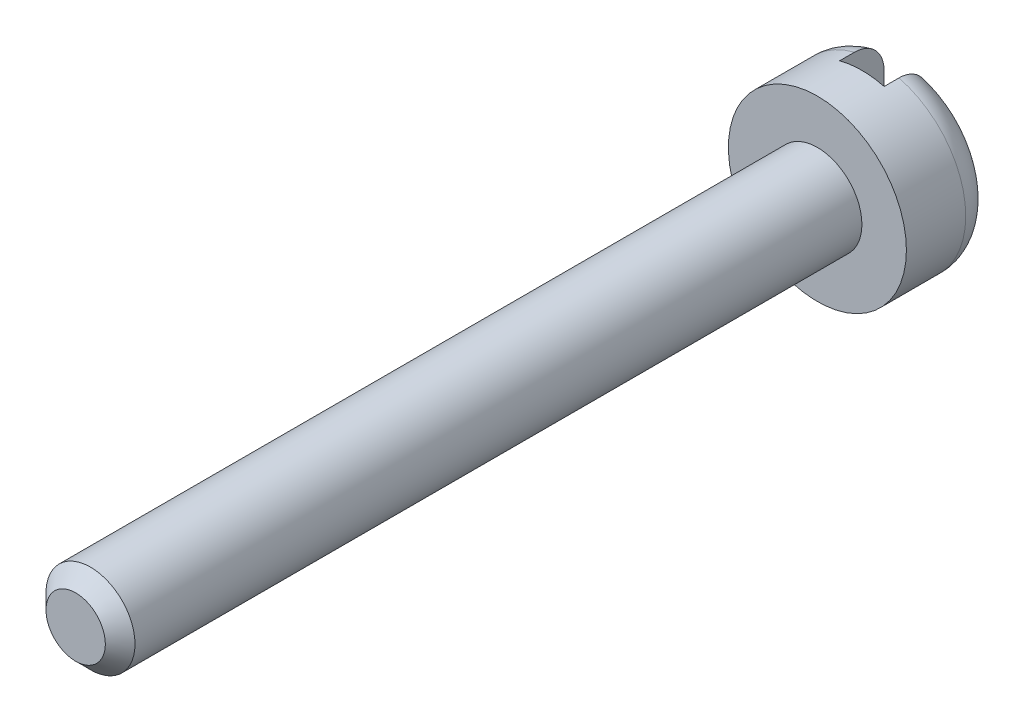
ISO-10303-21;
HEADER;
FILE_DESCRIPTION(('STEP AP214'),'2;1');
FILE_NAME('part.step','',(''),(''),'','','');
FILE_SCHEMA(('AUTOMOTIVE_DESIGN { 1 0 10303 214 1 1 1 1 }'));
ENDSEC;
DATA;
#1=APPLICATION_CONTEXT('core data for automotive mechanical design processes');
#2=APPLICATION_PROTOCOL_DEFINITION('international standard','automotive_design',2000,#1);
#3=PRODUCT_CONTEXT('',#1,'mechanical');
#4=PRODUCT('Part','Part','',(#3));
#5=PRODUCT_RELATED_PRODUCT_CATEGORY('part','',(#4));
#6=PRODUCT_DEFINITION_FORMATION('','',#4);
#7=PRODUCT_DEFINITION_CONTEXT('part definition',#1,'design');
#8=PRODUCT_DEFINITION('design','',#6,#7);
#9=PRODUCT_DEFINITION_SHAPE('','',#8);
#10=(LENGTH_UNIT() NAMED_UNIT(*) SI_UNIT(.MILLI.,.METRE.));
#11=(NAMED_UNIT(*) PLANE_ANGLE_UNIT() SI_UNIT($,.RADIAN.));
#12=(NAMED_UNIT(*) SI_UNIT($,.STERADIAN.) SOLID_ANGLE_UNIT());
#13=UNCERTAINTY_MEASURE_WITH_UNIT(LENGTH_MEASURE(1.E-05),#10,'distance_accuracy_value','');
#14=(GEOMETRIC_REPRESENTATION_CONTEXT(3) GLOBAL_UNCERTAINTY_ASSIGNED_CONTEXT((#13)) GLOBAL_UNIT_ASSIGNED_CONTEXT((#10,
#11,#12)) REPRESENTATION_CONTEXT('',''));
#15=CARTESIAN_POINT('',(0.,0.,0.));
#16=DIRECTION('',(0.,0.,1.));
#17=DIRECTION('',(1.,0.,0.));
#18=AXIS2_PLACEMENT_3D('',#15,#16,#17);
#19=CARTESIAN_POINT('',(0.,0.,3.));
#20=DIRECTION('',(0.,0.,1.));
#21=DIRECTION('',(1.,0.,0.));
#22=AXIS2_PLACEMENT_3D('',#19,#20,#21);
#23=PLANE('',#22);
#24=CARTESIAN_POINT('',(0.,0.,3.));
#25=DIRECTION('',(0.,0.,1.));
#26=DIRECTION('',(1.,0.,0.));
#27=AXIS2_PLACEMENT_3D('',#24,#25,#26);
#28=CIRCLE('',#27,3.);
#29=CARTESIAN_POINT('',(3.,0.,3.));
#30=VERTEX_POINT('',#29);
#31=EDGE_CURVE('E118',#30,#30,#28,.T.);
#32=ORIENTED_EDGE('',*,*,#31,.T.);
#33=EDGE_LOOP('',(#32));
#34=FACE_BOUND('',#33,.T.);
#35=CARTESIAN_POINT('',(0.,0.,3.));
#36=DIRECTION('',(0.,0.,1.));
#37=DIRECTION('',(1.,0.,0.));
#38=AXIS2_PLACEMENT_3D('',#35,#36,#37);
#39=CIRCLE('',#38,1.5);
#40=CARTESIAN_POINT('',(1.5,0.,3.));
#41=VERTEX_POINT('',#40);
#42=EDGE_CURVE('E102',#41,#41,#39,.T.);
#43=ORIENTED_EDGE('',*,*,#42,.F.);
#44=EDGE_LOOP('',(#43));
#45=FACE_BOUND('',#44,.T.);
#46=ADVANCED_FACE('F26',(#34,#45),#23,.T.);
#47=CARTESIAN_POINT('',(0.,0.,3.));
#48=DIRECTION('',(0.,0.,-1.));
#49=DIRECTION('',(-1.,0.,0.));
#50=AXIS2_PLACEMENT_3D('',#47,#48,#49);
#51=CYLINDRICAL_SURFACE('',#50,3.);
#52=ORIENTED_EDGE('',*,*,#31,.F.);
#53=EDGE_LOOP('',(#52));
#54=FACE_BOUND('',#53,.T.);
#55=DIRECTION('',(0.,0.,-1.));
#56=VECTOR('',#55,1.);
#57=CARTESIAN_POINT('',(-0.75,2.90473750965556,3.));
#58=LINE('',#57,#56);
#59=CARTESIAN_POINT('',(-0.75,2.90473750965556,1.));
#60=VERTEX_POINT('',#59);
#61=CARTESIAN_POINT('',(-0.75,2.90473750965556,1.5));
#62=VERTEX_POINT('',#61);
#63=EDGE_CURVE('E76',#60,#62,#58,.F.);
#64=ORIENTED_EDGE('',*,*,#63,.F.);
#65=CARTESIAN_POINT('',(0.,0.,1.));
#66=DIRECTION('',(0.,0.,1.));
#67=DIRECTION('',(1.,0.,0.));
#68=AXIS2_PLACEMENT_3D('',#65,#66,#67);
#69=CIRCLE('',#68,3.);
#70=CARTESIAN_POINT('',(-0.75,-2.90473750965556,1.));
#71=VERTEX_POINT('',#70);
#72=EDGE_CURVE('E130',#60,#71,#69,.T.);
#73=ORIENTED_EDGE('',*,*,#72,.T.);
#74=DIRECTION('',(0.,0.,-1.));
#75=VECTOR('',#74,1.);
#76=CARTESIAN_POINT('',(-0.75,-2.90473750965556,3.));
#77=LINE('',#76,#75);
#78=CARTESIAN_POINT('',(-0.75,-2.90473750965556,1.5));
#79=VERTEX_POINT('',#78);
#80=EDGE_CURVE('E116',#71,#79,#77,.F.);
#81=ORIENTED_EDGE('',*,*,#80,.T.);
#82=CARTESIAN_POINT('',(0.,0.,1.5));
#83=DIRECTION('',(0.,0.,-1.));
#84=DIRECTION('',(-1.,0.,0.));
#85=AXIS2_PLACEMENT_3D('',#82,#83,#84);
#86=CIRCLE('',#85,3.);
#87=CARTESIAN_POINT('',(0.75,-2.90473750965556,1.5));
#88=VERTEX_POINT('',#87);
#89=EDGE_CURVE('E98',#88,#79,#86,.T.);
#90=ORIENTED_EDGE('',*,*,#89,.F.);
#91=DIRECTION('',(0.,0.,-1.));
#92=VECTOR('',#91,1.);
#93=CARTESIAN_POINT('',(0.75,-2.90473750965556,3.));
#94=LINE('',#93,#92);
#95=CARTESIAN_POINT('',(0.75,-2.90473750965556,1.));
#96=VERTEX_POINT('',#95);
#97=EDGE_CURVE('E113',#88,#96,#94,.T.);
#98=ORIENTED_EDGE('',*,*,#97,.T.);
#99=CARTESIAN_POINT('',(0.,0.,1.));
#100=DIRECTION('',(0.,0.,1.));
#101=DIRECTION('',(1.,0.,0.));
#102=AXIS2_PLACEMENT_3D('',#99,#100,#101);
#103=CIRCLE('',#102,3.);
#104=CARTESIAN_POINT('',(0.75,2.90473750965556,1.));
#105=VERTEX_POINT('',#104);
#106=EDGE_CURVE('E128',#96,#105,#103,.T.);
#107=ORIENTED_EDGE('',*,*,#106,.T.);
#108=DIRECTION('',(0.,0.,-1.));
#109=VECTOR('',#108,1.);
#110=CARTESIAN_POINT('',(0.75,2.90473750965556,3.));
#111=LINE('',#110,#109);
#112=CARTESIAN_POINT('',(0.75,2.90473750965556,1.5));
#113=VERTEX_POINT('',#112);
#114=EDGE_CURVE('E88',#113,#105,#111,.T.);
#115=ORIENTED_EDGE('',*,*,#114,.F.);
#116=CARTESIAN_POINT('',(0.,0.,1.5));
#117=DIRECTION('',(0.,0.,1.));
#118=DIRECTION('',(1.,0.,0.));
#119=AXIS2_PLACEMENT_3D('',#116,#117,#118);
#120=CIRCLE('',#119,3.);
#121=EDGE_CURVE('E89',#113,#62,#120,.T.);
#122=ORIENTED_EDGE('',*,*,#121,.T.);
#123=EDGE_LOOP('',(#64,#73,#81,#90,#98,#107,#115,#122));
#124=FACE_BOUND('',#123,.T.);
#125=ADVANCED_FACE('F28',(#54,#124),#51,.T.);
#126=CARTESIAN_POINT('',(0.,0.,0.));
#127=DIRECTION('',(0.,0.,1.));
#128=DIRECTION('',(1.,0.,0.));
#129=AXIS2_PLACEMENT_3D('',#126,#127,#128);
#130=PLANE('',#129);
#131=DIRECTION('',(0.,1.,0.));
#132=VECTOR('',#131,1.);
#133=CARTESIAN_POINT('',(0.75,-23.,0.));
#134=LINE('',#133,#132);
#135=CARTESIAN_POINT('',(0.75,-1.85404962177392,0.));
#136=VERTEX_POINT('',#135);
#137=CARTESIAN_POINT('',(0.75,1.85404962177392,0.));
#138=VERTEX_POINT('',#137);
#139=EDGE_CURVE('E109',#136,#138,#134,.T.);
#140=ORIENTED_EDGE('',*,*,#139,.T.);
#141=CARTESIAN_POINT('',(0.,0.,0.));
#142=DIRECTION('',(0.,0.,1.));
#143=DIRECTION('',(1.,0.,0.));
#144=AXIS2_PLACEMENT_3D('',#141,#142,#143);
#145=CIRCLE('',#144,2.);
#146=EDGE_CURVE('E11',#138,#136,#145,.F.);
#147=ORIENTED_EDGE('',*,*,#146,.T.);
#148=EDGE_LOOP('',(#140,#147));
#149=FACE_BOUND('',#148,.T.);
#150=ADVANCED_FACE('F162',(#149),#130,.F.);
#151=DIRECTION('',(0.,1.,0.));
#152=VECTOR('',#151,1.);
#153=CARTESIAN_POINT('',(-0.75,-23.,0.));
#154=LINE('',#153,#152);
#155=CARTESIAN_POINT('',(-0.75,-1.85404962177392,0.));
#156=VERTEX_POINT('',#155);
#157=CARTESIAN_POINT('',(-0.75,1.85404962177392,0.));
#158=VERTEX_POINT('',#157);
#159=EDGE_CURVE('E111',#156,#158,#154,.T.);
#160=ORIENTED_EDGE('',*,*,#159,.F.);
#161=CARTESIAN_POINT('',(0.,0.,0.));
#162=DIRECTION('',(0.,0.,1.));
#163=DIRECTION('',(1.,0.,0.));
#164=AXIS2_PLACEMENT_3D('',#161,#162,#163);
#165=CIRCLE('',#164,2.);
#166=EDGE_CURVE('E260',#156,#158,#165,.F.);
#167=ORIENTED_EDGE('',*,*,#166,.T.);
#168=EDGE_LOOP('',(#160,#167));
#169=FACE_BOUND('',#168,.T.);
#170=ADVANCED_FACE('F157',(#169),#130,.F.);
#171=CARTESIAN_POINT('',(0.75,-23.,1.5));
#172=DIRECTION('',(0.,0.,-1.));
#173=DIRECTION('',(-1.,0.,0.));
#174=AXIS2_PLACEMENT_3D('',#171,#172,#173);
#175=PLANE('',#174);
#176=ORIENTED_EDGE('',*,*,#89,.T.);
#177=DIRECTION('',(0.,1.,0.));
#178=VECTOR('',#177,1.);
#179=CARTESIAN_POINT('',(-0.75,-23.,1.5));
#180=LINE('',#179,#178);
#181=EDGE_CURVE('E80',#79,#62,#180,.T.);
#182=ORIENTED_EDGE('',*,*,#181,.T.);
#183=ORIENTED_EDGE('',*,*,#121,.F.);
#184=DIRECTION('',(0.,1.,0.));
#185=VECTOR('',#184,1.);
#186=CARTESIAN_POINT('',(0.75,-23.,1.5));
#187=LINE('',#186,#185);
#188=EDGE_CURVE('E99',#88,#113,#187,.T.);
#189=ORIENTED_EDGE('',*,*,#188,.F.);
#190=EDGE_LOOP('',(#176,#182,#183,#189));
#191=FACE_BOUND('',#190,.T.);
#192=ADVANCED_FACE('F94',(#191),#175,.T.);
#193=CARTESIAN_POINT('',(-0.75,-23.,0.));
#194=DIRECTION('',(-1.,0.,0.));
#195=DIRECTION('',(0.,0.,1.));
#196=AXIS2_PLACEMENT_3D('',#193,#194,#195);
#197=PLANE('',#196);
#198=ORIENTED_EDGE('',*,*,#80,.F.);
#199=CARTESIAN_POINT('',(-0.75,-2.90473750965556,1.));
#200=CARTESIAN_POINT('',(-0.75,-2.90473763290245,0.972581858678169));
#201=CARTESIAN_POINT('',(-0.75,-2.90357213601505,0.945177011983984));
#202=CARTESIAN_POINT('',(-0.75,-2.89892461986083,0.89056698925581));
#203=CARTESIAN_POINT('',(-0.75,-2.89544281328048,0.86336179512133));
#204=CARTESIAN_POINT('',(-0.75,-2.88156639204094,0.782424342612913));
#205=CARTESIAN_POINT('',(-0.75,-2.86774061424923,0.729240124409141));
#206=CARTESIAN_POINT('',(-0.75,-2.83137231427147,0.625959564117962));
#207=CARTESIAN_POINT('',(-0.75,-2.80882749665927,0.575864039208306));
#208=CARTESIAN_POINT('',(-0.75,-2.75572895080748,0.480111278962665));
#209=CARTESIAN_POINT('',(-0.75,-2.72517497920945,0.434454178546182));
#210=CARTESIAN_POINT('',(-0.75,-2.6566421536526,0.348333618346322));
#211=CARTESIAN_POINT('',(-0.75,-2.61858977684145,0.307928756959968));
#212=CARTESIAN_POINT('',(-0.75,-2.5364153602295,0.233863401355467));
#213=CARTESIAN_POINT('',(-0.75,-2.49229290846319,0.200203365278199));
#214=CARTESIAN_POINT('',(-0.75,-2.39787489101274,0.1394758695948));
#215=CARTESIAN_POINT('',(-0.75,-2.34743551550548,0.112632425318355));
#216=CARTESIAN_POINT('',(-0.75,-2.24289481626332,0.0673581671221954));
#217=CARTESIAN_POINT('',(-0.75,-2.18879197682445,0.0489308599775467));
#218=CARTESIAN_POINT('',(-0.75,-2.08794523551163,0.0231447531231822));
#219=CARTESIAN_POINT('',(-0.75,-2.04154127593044,0.0144251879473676));
#220=CARTESIAN_POINT('',(-0.75,-1.94810380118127,0.00285077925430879));
#221=CARTESIAN_POINT('',(-0.75,-1.90107181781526,-1.63777204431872E-05));
#222=CARTESIAN_POINT('',(-0.75,-1.85404962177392,0.));
#223=B_SPLINE_CURVE_WITH_KNOTS('',3,(#199,#200,#201,#202,#203,#204,#205,#206,#207,#208,#209,
#210,#211,#212,#213,#214,#215,#216,#217,#218,#219,#220,#221,#222),.UNSPECIFIED.,.F.,.F.,(4,2,2,
2,2,2,2,2,2,2,2,4),(0.,0.0822033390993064,0.164399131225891,0.328405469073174,0.492455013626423,
0.656509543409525,0.822260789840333,0.988023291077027,1.1586804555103,1.32940866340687,
1.47069439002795,1.61168254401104),.UNSPECIFIED.);
#224=EDGE_CURVE('E138',#71,#156,#223,.T.);
#225=ORIENTED_EDGE('',*,*,#224,.T.);
#226=ORIENTED_EDGE('',*,*,#159,.T.);
#227=CARTESIAN_POINT('',(-0.75,1.85404962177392,0.));
#228=CARTESIAN_POINT('',(-0.75,1.885020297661,2.66444596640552E-07));
#229=CARTESIAN_POINT('',(-0.75,1.9159798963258,0.00123744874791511));
#230=CARTESIAN_POINT('',(-0.75,1.97770498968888,0.00622614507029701));
#231=CARTESIAN_POINT('',(-0.75,2.00847041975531,0.00997845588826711));
#232=CARTESIAN_POINT('',(-0.75,2.10024297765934,0.0250767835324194));
#233=CARTESIAN_POINT('',(-0.75,2.16066983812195,0.0402643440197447));
#234=CARTESIAN_POINT('',(-0.75,2.27813769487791,0.0808473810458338));
#235=CARTESIAN_POINT('',(-0.75,2.33517060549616,0.106266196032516));
#236=CARTESIAN_POINT('',(-0.75,2.44377621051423,0.166808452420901));
#237=CARTESIAN_POINT('',(-0.75,2.49535534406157,0.201920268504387));
#238=CARTESIAN_POINT('',(-0.75,2.5888100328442,0.278913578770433));
#239=CARTESIAN_POINT('',(-0.75,2.63104720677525,0.320356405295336));
#240=CARTESIAN_POINT('',(-0.75,2.70758881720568,0.410054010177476));
#241=CARTESIAN_POINT('',(-0.75,2.74189148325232,0.45831030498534));
#242=CARTESIAN_POINT('',(-0.75,2.80002141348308,0.557922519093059));
#243=CARTESIAN_POINT('',(-0.75,2.82424256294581,0.609049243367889));
#244=CARTESIAN_POINT('',(-0.75,2.86348569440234,0.714688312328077));
#245=CARTESIAN_POINT('',(-0.75,2.87851844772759,0.769196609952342));
#246=CARTESIAN_POINT('',(-0.75,2.89404536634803,0.853491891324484));
#247=CARTESIAN_POINT('',(-0.75,2.89805402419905,0.88267236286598));
#248=CARTESIAN_POINT('',(-0.75,2.90339826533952,0.94123043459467));
#249=CARTESIAN_POINT('',(-0.75,2.90473807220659,0.970607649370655));
#250=CARTESIAN_POINT('',(-0.75,2.90473750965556,1.));
#251=B_SPLINE_CURVE_WITH_KNOTS('',3,(#227,#228,#229,#230,#231,#232,#233,#234,#235,#236,#237,
#238,#239,#240,#241,#242,#243,#244,#245,#246,#247,#248,#249,#250),.UNSPECIFIED.,.F.,.F.,(4,2,2,
2,2,2,2,2,2,2,2,4),(0.,0.0928629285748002,0.185755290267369,0.371707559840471,0.558086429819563,
0.744242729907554,0.920867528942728,1.0975317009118,1.26643739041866,1.43514469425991,
1.52340112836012,1.61151778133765),.UNSPECIFIED.);
#252=EDGE_CURVE('E83',#158,#60,#251,.T.);
#253=ORIENTED_EDGE('',*,*,#252,.T.);
#254=ORIENTED_EDGE('',*,*,#63,.T.);
#255=ORIENTED_EDGE('',*,*,#181,.F.);
#256=EDGE_LOOP('',(#198,#225,#226,#253,#254,#255));
#257=FACE_BOUND('',#256,.T.);
#258=ADVANCED_FACE('F79',(#257),#197,.F.);
#259=CARTESIAN_POINT('',(0.75,-23.,1.5));
#260=DIRECTION('',(1.,0.,0.));
#261=DIRECTION('',(0.,0.,-1.));
#262=AXIS2_PLACEMENT_3D('',#259,#260,#261);
#263=PLANE('',#262);
#264=ORIENTED_EDGE('',*,*,#114,.T.);
#265=CARTESIAN_POINT('',(0.75,2.90473750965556,1.));
#266=CARTESIAN_POINT('',(0.75,2.90473763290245,0.972581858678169));
#267=CARTESIAN_POINT('',(0.75,2.90357213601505,0.945177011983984));
#268=CARTESIAN_POINT('',(0.75,2.89892461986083,0.89056698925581));
#269=CARTESIAN_POINT('',(0.75,2.89544281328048,0.86336179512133));
#270=CARTESIAN_POINT('',(0.75,2.88156639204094,0.782424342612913));
#271=CARTESIAN_POINT('',(0.75,2.86774061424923,0.729240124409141));
#272=CARTESIAN_POINT('',(0.75,2.83137231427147,0.625959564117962));
#273=CARTESIAN_POINT('',(0.75,2.80882749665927,0.575864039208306));
#274=CARTESIAN_POINT('',(0.75,2.75572895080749,0.480111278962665));
#275=CARTESIAN_POINT('',(0.75,2.72517497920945,0.434454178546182));
#276=CARTESIAN_POINT('',(0.75,2.6566421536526,0.348333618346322));
#277=CARTESIAN_POINT('',(0.75,2.61858977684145,0.307928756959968));
#278=CARTESIAN_POINT('',(0.75,2.5364153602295,0.233863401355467));
#279=CARTESIAN_POINT('',(0.75,2.49229290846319,0.200203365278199));
#280=CARTESIAN_POINT('',(0.75,2.39787489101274,0.1394758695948));
#281=CARTESIAN_POINT('',(0.75,2.34743551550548,0.112632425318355));
#282=CARTESIAN_POINT('',(0.75,2.24289481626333,0.0673581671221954));
#283=CARTESIAN_POINT('',(0.75,2.18879197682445,0.0489308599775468));
#284=CARTESIAN_POINT('',(0.75,2.08794523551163,0.0231447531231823));
#285=CARTESIAN_POINT('',(0.75,2.04154127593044,0.0144251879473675));
#286=CARTESIAN_POINT('',(0.75,1.94810380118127,0.00285077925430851));
#287=CARTESIAN_POINT('',(0.75,1.90107181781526,-1.63777204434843E-05));
#288=CARTESIAN_POINT('',(0.75,1.85404962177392,0.));
#289=B_SPLINE_CURVE_WITH_KNOTS('',3,(#265,#266,#267,#268,#269,#270,#271,#272,#273,#274,#275,
#276,#277,#278,#279,#280,#281,#282,#283,#284,#285,#286,#287,#288),.UNSPECIFIED.,.F.,.F.,(4,2,2,
2,2,2,2,2,2,2,2,4),(0.,0.0822033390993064,0.164399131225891,0.328405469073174,0.492455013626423,
0.656509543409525,0.822260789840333,0.988023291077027,1.1586804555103,1.32940866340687,
1.47069439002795,1.61168254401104),.UNSPECIFIED.);
#290=EDGE_CURVE('E34',#105,#138,#289,.T.);
#291=ORIENTED_EDGE('',*,*,#290,.T.);
#292=ORIENTED_EDGE('',*,*,#139,.F.);
#293=CARTESIAN_POINT('',(0.75,-1.85404962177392,0.));
#294=CARTESIAN_POINT('',(0.75,-1.885020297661,2.66444596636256E-07));
#295=CARTESIAN_POINT('',(0.75,-1.9159798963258,0.0012374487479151));
#296=CARTESIAN_POINT('',(0.75,-1.97770498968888,0.00622614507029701));
#297=CARTESIAN_POINT('',(0.75,-2.00847041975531,0.00997845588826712));
#298=CARTESIAN_POINT('',(0.75,-2.10024297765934,0.0250767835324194));
#299=CARTESIAN_POINT('',(0.75,-2.16066983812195,0.0402643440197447));
#300=CARTESIAN_POINT('',(0.75,-2.27813769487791,0.0808473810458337));
#301=CARTESIAN_POINT('',(0.75,-2.33517060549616,0.106266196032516));
#302=CARTESIAN_POINT('',(0.75,-2.44377621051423,0.166808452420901));
#303=CARTESIAN_POINT('',(0.75,-2.49535534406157,0.201920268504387));
#304=CARTESIAN_POINT('',(0.75,-2.5888100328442,0.278913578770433));
#305=CARTESIAN_POINT('',(0.75,-2.63104720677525,0.320356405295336));
#306=CARTESIAN_POINT('',(0.75,-2.70758881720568,0.410054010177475));
#307=CARTESIAN_POINT('',(0.75,-2.74189148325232,0.45831030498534));
#308=CARTESIAN_POINT('',(0.75,-2.80002141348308,0.557922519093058));
#309=CARTESIAN_POINT('',(0.75,-2.82424256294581,0.609049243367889));
#310=CARTESIAN_POINT('',(0.75,-2.86348569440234,0.714688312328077));
#311=CARTESIAN_POINT('',(0.75,-2.87851844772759,0.769196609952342));
#312=CARTESIAN_POINT('',(0.75,-2.89404536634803,0.853491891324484));
#313=CARTESIAN_POINT('',(0.75,-2.89805402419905,0.88267236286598));
#314=CARTESIAN_POINT('',(0.75,-2.90339826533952,0.94123043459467));
#315=CARTESIAN_POINT('',(0.75,-2.90473807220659,0.970607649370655));
#316=CARTESIAN_POINT('',(0.75,-2.90473750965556,1.));
#317=B_SPLINE_CURVE_WITH_KNOTS('',3,(#293,#294,#295,#296,#297,#298,#299,#300,#301,#302,#303,
#304,#305,#306,#307,#308,#309,#310,#311,#312,#313,#314,#315,#316),.UNSPECIFIED.,.F.,.F.,(4,2,2,
2,2,2,2,2,2,2,2,4),(0.,0.0928629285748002,0.185755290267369,0.371707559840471,0.558086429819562,
0.744242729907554,0.920867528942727,1.0975317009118,1.26643739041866,1.43514469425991,
1.52340112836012,1.61151778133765),.UNSPECIFIED.);
#318=EDGE_CURVE('E165',#136,#96,#317,.T.);
#319=ORIENTED_EDGE('',*,*,#318,.T.);
#320=ORIENTED_EDGE('',*,*,#97,.F.);
#321=ORIENTED_EDGE('',*,*,#188,.T.);
#322=EDGE_LOOP('',(#264,#291,#292,#319,#320,#321));
#323=FACE_BOUND('',#322,.T.);
#324=ADVANCED_FACE('F151',(#323),#263,.F.);
#325=CARTESIAN_POINT('',(0.,0.,28.));
#326=DIRECTION('',(0.,0.,-1.));
#327=DIRECTION('',(-1.,0.,0.));
#328=AXIS2_PLACEMENT_3D('',#325,#326,#327);
#329=CYLINDRICAL_SURFACE('',#328,1.5);
#330=CARTESIAN_POINT('',(0.,0.,27.5));
#331=DIRECTION('',(0.,0.,1.));
#332=DIRECTION('',(1.,0.,0.));
#333=AXIS2_PLACEMENT_3D('',#330,#331,#332);
#334=CIRCLE('',#333,1.5);
#335=CARTESIAN_POINT('',(1.5,0.,27.5));
#336=VERTEX_POINT('',#335);
#337=EDGE_CURVE('E125',#336,#336,#334,.F.);
#338=ORIENTED_EDGE('',*,*,#337,.T.);
#339=EDGE_LOOP('',(#338));
#340=FACE_BOUND('',#339,.T.);
#341=ORIENTED_EDGE('',*,*,#42,.T.);
#342=EDGE_LOOP('',(#341));
#343=FACE_BOUND('',#342,.T.);
#344=ADVANCED_FACE('F152',(#340,#343),#329,.T.);
#345=CARTESIAN_POINT('',(0.,0.,28.));
#346=DIRECTION('',(0.,0.,1.));
#347=DIRECTION('',(1.,0.,0.));
#348=AXIS2_PLACEMENT_3D('',#345,#346,#347);
#349=PLANE('',#348);
#350=CARTESIAN_POINT('',(0.,0.,28.));
#351=DIRECTION('',(0.,0.,1.));
#352=DIRECTION('',(1.,0.,0.));
#353=AXIS2_PLACEMENT_3D('',#350,#351,#352);
#354=CIRCLE('',#353,0.999999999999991);
#355=CARTESIAN_POINT('',(0.999999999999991,0.,28.));
#356=VERTEX_POINT('',#355);
#357=EDGE_CURVE('E122',#356,#356,#354,.T.);
#358=ORIENTED_EDGE('',*,*,#357,.T.);
#359=EDGE_LOOP('',(#358));
#360=FACE_BOUND('',#359,.T.);
#361=ADVANCED_FACE('F161',(#360),#349,.T.);
#362=CARTESIAN_POINT('',(0.,0.,28.));
#363=DIRECTION('',(0.,0.,-1.));
#364=DIRECTION('',(-1.,0.,0.));
#365=AXIS2_PLACEMENT_3D('',#362,#363,#364);
#366=CONICAL_SURFACE('',#365,0.999999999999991,0.785398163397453);
#367=ORIENTED_EDGE('',*,*,#337,.F.);
#368=EDGE_LOOP('',(#367));
#369=FACE_BOUND('',#368,.T.);
#370=ORIENTED_EDGE('',*,*,#357,.F.);
#371=EDGE_LOOP('',(#370));
#372=FACE_BOUND('',#371,.T.);
#373=ADVANCED_FACE('F180',(#369,#372),#366,.T.);
#374=CARTESIAN_POINT('',(0.,0.,1.));
#375=DIRECTION('',(0.,0.,1.));
#376=DIRECTION('',(1.,0.,0.));
#377=AXIS2_PLACEMENT_3D('',#374,#375,#376);
#378=TOROIDAL_SURFACE('',#377,2.,1.);
#379=ORIENTED_EDGE('',*,*,#252,.F.);
#380=ORIENTED_EDGE('',*,*,#166,.F.);
#381=ORIENTED_EDGE('',*,*,#224,.F.);
#382=ORIENTED_EDGE('',*,*,#72,.F.);
#383=EDGE_LOOP('',(#379,#380,#381,#382));
#384=FACE_BOUND('',#383,.T.);
#385=ADVANCED_FACE('F143',(#384),#378,.T.);
#386=CARTESIAN_POINT('',(0.,0.,1.));
#387=DIRECTION('',(0.,0.,1.));
#388=DIRECTION('',(1.,0.,0.));
#389=AXIS2_PLACEMENT_3D('',#386,#387,#388);
#390=TOROIDAL_SURFACE('',#389,2.,1.);
#391=ORIENTED_EDGE('',*,*,#318,.F.);
#392=ORIENTED_EDGE('',*,*,#146,.F.);
#393=ORIENTED_EDGE('',*,*,#290,.F.);
#394=ORIENTED_EDGE('',*,*,#106,.F.);
#395=EDGE_LOOP('',(#391,#392,#393,#394));
#396=FACE_BOUND('',#395,.T.);
#397=ADVANCED_FACE('F172',(#396),#390,.T.);
#398=CLOSED_SHELL('',(#46,#125,#150,#170,#192,#258,#324,#344,#361,#373,#385,#397));
#399=MANIFOLD_SOLID_BREP('B2',#398);
#400=ADVANCED_BREP_SHAPE_REPRESENTATION('',(#18,#399),#14);
#401=SHAPE_DEFINITION_REPRESENTATION(#9,#400);
ENDSEC;
END-ISO-10303-21;
